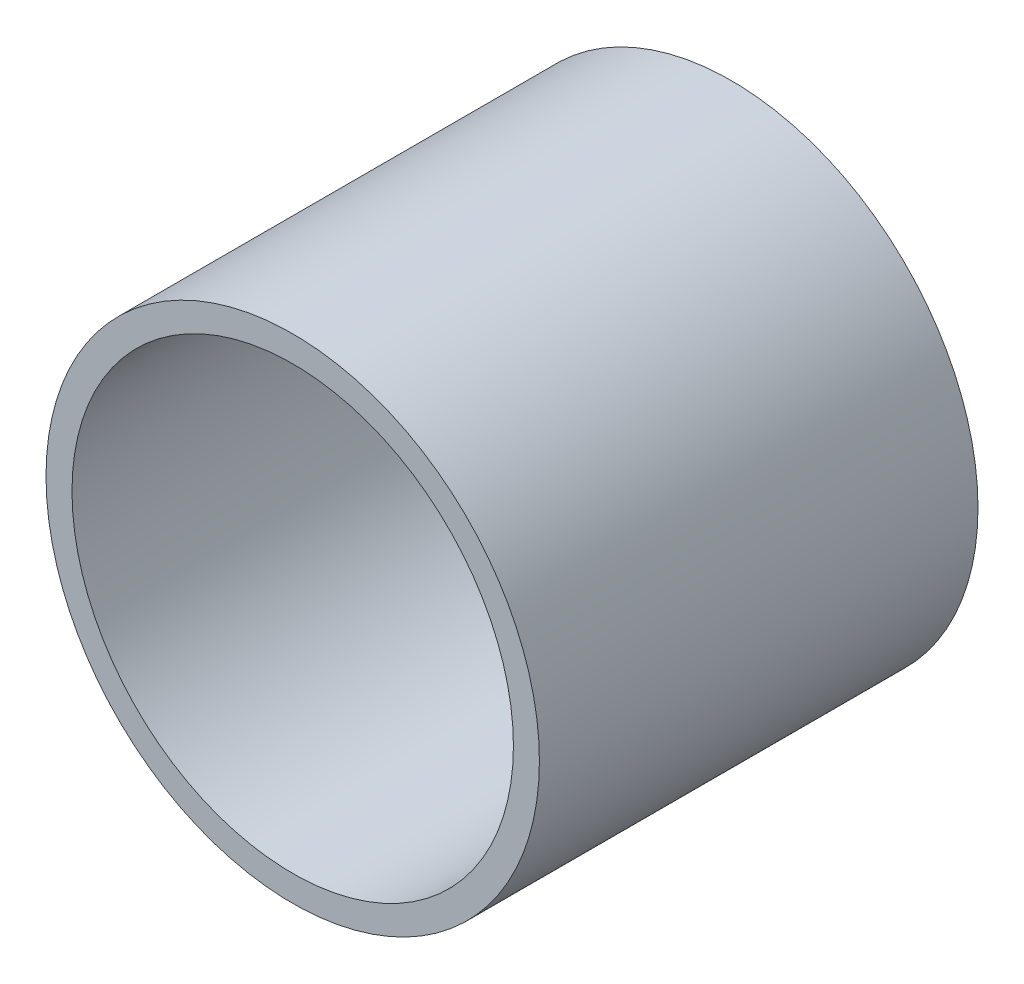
ISO-10303-21;
HEADER;
FILE_DESCRIPTION(('STEP AP214'),'2;1');
FILE_NAME('part.step','',(''),(''),'','','');
FILE_SCHEMA(('AUTOMOTIVE_DESIGN { 1 0 10303 214 1 1 1 1 }'));
ENDSEC;
DATA;
#1=APPLICATION_CONTEXT('core data for automotive mechanical design processes');
#2=APPLICATION_PROTOCOL_DEFINITION('international standard','automotive_design',2000,#1);
#3=PRODUCT_CONTEXT('',#1,'mechanical');
#4=PRODUCT('Part','Part','',(#3));
#5=PRODUCT_RELATED_PRODUCT_CATEGORY('part','',(#4));
#6=PRODUCT_DEFINITION_FORMATION('','',#4);
#7=PRODUCT_DEFINITION_CONTEXT('part definition',#1,'design');
#8=PRODUCT_DEFINITION('design','',#6,#7);
#9=PRODUCT_DEFINITION_SHAPE('','',#8);
#10=(LENGTH_UNIT() NAMED_UNIT(*) SI_UNIT(.MILLI.,.METRE.));
#11=(NAMED_UNIT(*) PLANE_ANGLE_UNIT() SI_UNIT($,.RADIAN.));
#12=(NAMED_UNIT(*) SI_UNIT($,.STERADIAN.) SOLID_ANGLE_UNIT());
#13=UNCERTAINTY_MEASURE_WITH_UNIT(LENGTH_MEASURE(1.E-05),#10,'distance_accuracy_value','');
#14=(GEOMETRIC_REPRESENTATION_CONTEXT(3) GLOBAL_UNCERTAINTY_ASSIGNED_CONTEXT((#13)) GLOBAL_UNIT_ASSIGNED_CONTEXT((#10,
#11,#12)) REPRESENTATION_CONTEXT('',''));
#15=CARTESIAN_POINT('',(0.,0.,0.));
#16=DIRECTION('',(0.,0.,1.));
#17=DIRECTION('',(1.,0.,0.));
#18=AXIS2_PLACEMENT_3D('',#15,#16,#17);
#19=CARTESIAN_POINT('',(0.,0.,50.8));
#20=DIRECTION('',(0.,0.,1.));
#21=DIRECTION('',(1.,0.,0.));
#22=AXIS2_PLACEMENT_3D('',#19,#20,#21);
#23=PLANE('',#22);
#24=CARTESIAN_POINT('',(0.,0.,50.8));
#25=DIRECTION('',(0.,0.,1.));
#26=DIRECTION('',(1.,0.,0.));
#27=AXIS2_PLACEMENT_3D('',#24,#25,#26);
#28=CIRCLE('',#27,57.15);
#29=CARTESIAN_POINT('',(57.15,0.,50.8));
#30=VERTEX_POINT('',#29);
#31=EDGE_CURVE('E10',#30,#30,#28,.T.);
#32=ORIENTED_EDGE('',*,*,#31,.T.);
#33=EDGE_LOOP('',(#32));
#34=FACE_BOUND('',#33,.T.);
#35=CARTESIAN_POINT('',(0.,0.,50.8));
#36=DIRECTION('',(0.,0.,1.));
#37=DIRECTION('',(1.,0.,0.));
#38=AXIS2_PLACEMENT_3D('',#35,#36,#37);
#39=CIRCLE('',#38,51.1302);
#40=CARTESIAN_POINT('',(51.1302,0.,50.8));
#41=VERTEX_POINT('',#40);
#42=EDGE_CURVE('E43',#41,#41,#39,.T.);
#43=ORIENTED_EDGE('',*,*,#42,.F.);
#44=EDGE_LOOP('',(#43));
#45=FACE_BOUND('',#44,.T.);
#46=ADVANCED_FACE('F32',(#34,#45),#23,.T.);
#47=CARTESIAN_POINT('',(0.,0.,-50.8));
#48=DIRECTION('',(0.,0.,1.));
#49=DIRECTION('',(1.,0.,0.));
#50=AXIS2_PLACEMENT_3D('',#47,#48,#49);
#51=PLANE('',#50);
#52=CARTESIAN_POINT('',(0.,0.,-50.8));
#53=DIRECTION('',(0.,0.,1.));
#54=DIRECTION('',(1.,0.,0.));
#55=AXIS2_PLACEMENT_3D('',#52,#53,#54);
#56=CIRCLE('',#55,57.15);
#57=CARTESIAN_POINT('',(57.15,0.,-50.8));
#58=VERTEX_POINT('',#57);
#59=EDGE_CURVE('E36',#58,#58,#56,.T.);
#60=ORIENTED_EDGE('',*,*,#59,.F.);
#61=EDGE_LOOP('',(#60));
#62=FACE_BOUND('',#61,.T.);
#63=CARTESIAN_POINT('',(0.,0.,-50.8));
#64=DIRECTION('',(0.,0.,1.));
#65=DIRECTION('',(1.,0.,0.));
#66=AXIS2_PLACEMENT_3D('',#63,#64,#65);
#67=CIRCLE('',#66,51.1302);
#68=CARTESIAN_POINT('',(51.1302,0.,-50.8));
#69=VERTEX_POINT('',#68);
#70=EDGE_CURVE('E45',#69,#69,#67,.T.);
#71=ORIENTED_EDGE('',*,*,#70,.T.);
#72=EDGE_LOOP('',(#71));
#73=FACE_BOUND('',#72,.T.);
#74=ADVANCED_FACE('F55',(#62,#73),#51,.F.);
#75=CARTESIAN_POINT('',(0.,0.,50.8));
#76=DIRECTION('',(0.,0.,-1.));
#77=DIRECTION('',(-1.,0.,0.));
#78=AXIS2_PLACEMENT_3D('',#75,#76,#77);
#79=CYLINDRICAL_SURFACE('',#78,57.15);
#80=ORIENTED_EDGE('',*,*,#31,.F.);
#81=EDGE_LOOP('',(#80));
#82=FACE_BOUND('',#81,.T.);
#83=ORIENTED_EDGE('',*,*,#59,.T.);
#84=EDGE_LOOP('',(#83));
#85=FACE_BOUND('',#84,.T.);
#86=ADVANCED_FACE('F34',(#82,#85),#79,.T.);
#87=CARTESIAN_POINT('',(0.,0.,50.8));
#88=DIRECTION('',(0.,0.,-1.));
#89=DIRECTION('',(-1.,0.,0.));
#90=AXIS2_PLACEMENT_3D('',#87,#88,#89);
#91=CYLINDRICAL_SURFACE('',#90,51.1302);
#92=ORIENTED_EDGE('',*,*,#42,.T.);
#93=EDGE_LOOP('',(#92));
#94=FACE_BOUND('',#93,.T.);
#95=ORIENTED_EDGE('',*,*,#70,.F.);
#96=EDGE_LOOP('',(#95));
#97=FACE_BOUND('',#96,.T.);
#98=ADVANCED_FACE('F51',(#94,#97),#91,.F.);
#99=CLOSED_SHELL('',(#46,#74,#86,#98));
#100=MANIFOLD_SOLID_BREP('B2',#99);
#101=ADVANCED_BREP_SHAPE_REPRESENTATION('',(#18,#100),#14);
#102=SHAPE_DEFINITION_REPRESENTATION(#9,#101);
ENDSEC;
END-ISO-10303-21;
